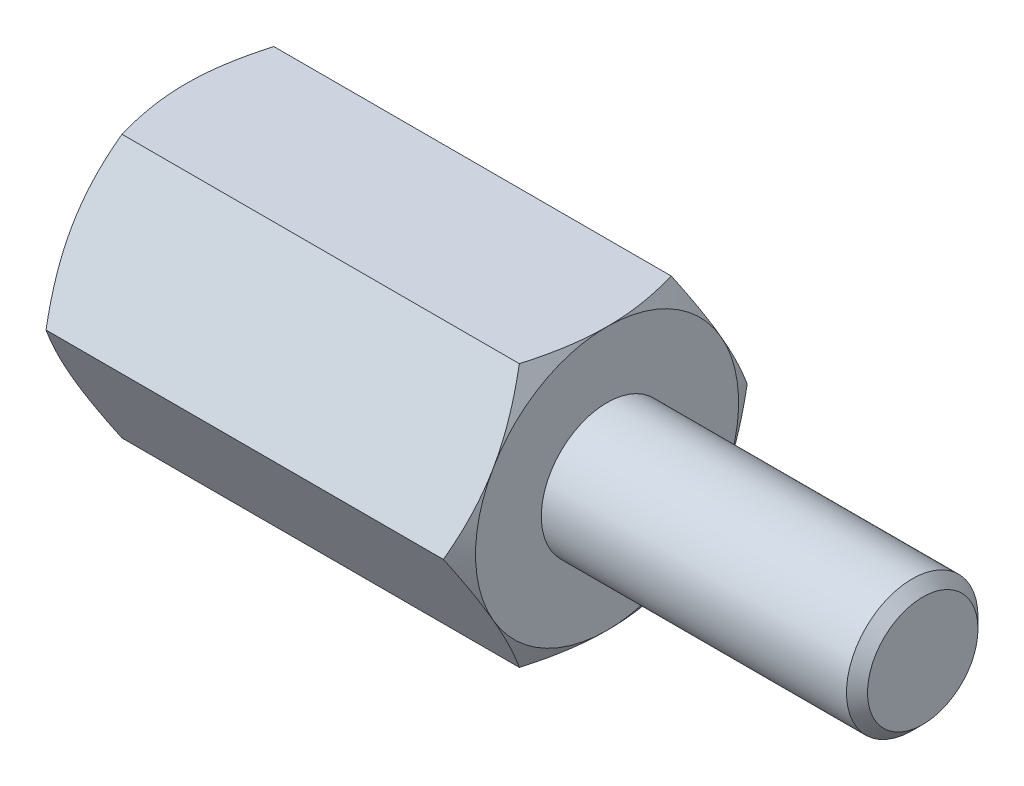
ISO-10303-21;
HEADER;
FILE_DESCRIPTION(('STEP AP214'),'2;1');
FILE_NAME('part.step','',(''),(''),'','','');
FILE_SCHEMA(('AUTOMOTIVE_DESIGN { 1 0 10303 214 1 1 1 1 }'));
ENDSEC;
DATA;
#1=APPLICATION_CONTEXT('core data for automotive mechanical design processes');
#2=APPLICATION_PROTOCOL_DEFINITION('international standard','automotive_design',2000,#1);
#3=PRODUCT_CONTEXT('',#1,'mechanical');
#4=PRODUCT('Part','Part','',(#3));
#5=PRODUCT_RELATED_PRODUCT_CATEGORY('part','',(#4));
#6=PRODUCT_DEFINITION_FORMATION('','',#4);
#7=PRODUCT_DEFINITION_CONTEXT('part definition',#1,'design');
#8=PRODUCT_DEFINITION('design','',#6,#7);
#9=PRODUCT_DEFINITION_SHAPE('','',#8);
#10=(LENGTH_UNIT() NAMED_UNIT(*) SI_UNIT(.MILLI.,.METRE.));
#11=(NAMED_UNIT(*) PLANE_ANGLE_UNIT() SI_UNIT($,.RADIAN.));
#12=(NAMED_UNIT(*) SI_UNIT($,.STERADIAN.) SOLID_ANGLE_UNIT());
#13=UNCERTAINTY_MEASURE_WITH_UNIT(LENGTH_MEASURE(1.E-05),#10,'distance_accuracy_value','');
#14=(GEOMETRIC_REPRESENTATION_CONTEXT(3) GLOBAL_UNCERTAINTY_ASSIGNED_CONTEXT((#13)) GLOBAL_UNIT_ASSIGNED_CONTEXT((#10,
#11,#12)) REPRESENTATION_CONTEXT('',''));
#15=CARTESIAN_POINT('',(0.,0.,0.));
#16=DIRECTION('',(0.,0.,1.));
#17=DIRECTION('',(1.,0.,0.));
#18=AXIS2_PLACEMENT_3D('',#15,#16,#17);
#19=CARTESIAN_POINT('',(4.,2.5,-1.44337567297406));
#20=DIRECTION('',(1.,0.,0.));
#21=DIRECTION('',(0.,0.,-1.));
#22=AXIS2_PLACEMENT_3D('',#19,#20,#21);
#23=PLANE('',#22);
#24=CARTESIAN_POINT('',(4.,0.,0.));
#25=DIRECTION('',(1.,0.,0.));
#26=DIRECTION('',(0.,0.,-1.));
#27=AXIS2_PLACEMENT_3D('',#24,#25,#26);
#28=CIRCLE('',#27,2.5);
#29=CARTESIAN_POINT('',(4.,-1.25,-2.1650635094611));
#30=VERTEX_POINT('',#29);
#31=CARTESIAN_POINT('',(4.,1.25,-2.1650635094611));
#32=VERTEX_POINT('',#31);
#33=EDGE_CURVE('E288',#30,#32,#28,.T.);
#34=ORIENTED_EDGE('',*,*,#33,.T.);
#35=CARTESIAN_POINT('',(4.,2.5,0.));
#36=VERTEX_POINT('',#35);
#37=EDGE_CURVE('E53',#32,#36,#28,.T.);
#38=ORIENTED_EDGE('',*,*,#37,.T.);
#39=CARTESIAN_POINT('',(4.,1.25,2.1650635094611));
#40=VERTEX_POINT('',#39);
#41=EDGE_CURVE('E296',#36,#40,#28,.T.);
#42=ORIENTED_EDGE('',*,*,#41,.T.);
#43=CARTESIAN_POINT('',(4.,-1.25,2.1650635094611));
#44=VERTEX_POINT('',#43);
#45=EDGE_CURVE('E301',#40,#44,#28,.T.);
#46=ORIENTED_EDGE('',*,*,#45,.T.);
#47=CARTESIAN_POINT('',(4.,0.,0.));
#48=DIRECTION('',(-1.,0.,0.));
#49=DIRECTION('',(0.,-1.,0.));
#50=AXIS2_PLACEMENT_3D('',#47,#48,#49);
#51=CIRCLE('',#50,2.5);
#52=CARTESIAN_POINT('',(4.,-2.5,0.));
#53=VERTEX_POINT('',#52);
#54=EDGE_CURVE('E193',#53,#44,#51,.T.);
#55=ORIENTED_EDGE('',*,*,#54,.F.);
#56=EDGE_CURVE('E61',#53,#30,#28,.T.);
#57=ORIENTED_EDGE('',*,*,#56,.T.);
#58=EDGE_LOOP('',(#34,#38,#42,#46,#55,#57));
#59=FACE_BOUND('',#58,.T.);
#60=CARTESIAN_POINT('',(4.,0.,0.));
#61=DIRECTION('',(1.,0.,0.));
#62=DIRECTION('',(0.,0.,-1.));
#63=AXIS2_PLACEMENT_3D('',#60,#61,#62);
#64=CIRCLE('',#63,1.25);
#65=CARTESIAN_POINT('',(4.,0.,-1.25));
#66=VERTEX_POINT('',#65);
#67=EDGE_CURVE('E421',#66,#66,#64,.T.);
#68=ORIENTED_EDGE('',*,*,#67,.F.);
#69=EDGE_LOOP('',(#68));
#70=FACE_BOUND('',#69,.T.);
#71=ADVANCED_FACE('F37',(#59,#70),#23,.T.);
#72=CARTESIAN_POINT('',(4.,0.,-2.88675134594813));
#73=DIRECTION('',(0.,-0.5,0.866025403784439));
#74=DIRECTION('',(0.,-0.866025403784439,-0.5));
#75=AXIS2_PLACEMENT_3D('',#72,#73,#74);
#76=PLANE('',#75);
#77=CARTESIAN_POINT('',(3.77664233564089,-0.000199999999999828,-2.88686681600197));
#78=CARTESIAN_POINT('',(3.81327837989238,0.109663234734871,-2.82343724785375));
#79=CARTESIAN_POINT('',(3.84659778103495,0.220474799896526,-2.75946016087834));
#80=CARTESIAN_POINT('',(3.90475771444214,0.444016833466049,-2.63039810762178));
#81=CARTESIAN_POINT('',(3.92957767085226,0.556751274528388,-2.5653108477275));
#82=CARTESIAN_POINT('',(3.96821434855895,0.780822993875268,-2.43594298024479));
#83=CARTESIAN_POINT('',(3.98228820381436,0.892125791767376,-2.37168227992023));
#84=CARTESIAN_POINT('',(3.99909084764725,1.11525522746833,-2.24285844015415));
#85=CARTESIAN_POINT('',(4.00183354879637,1.22708105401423,-2.17829576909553));
#86=CARTESIAN_POINT('',(3.99613423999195,1.43604197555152,-2.05765212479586));
#87=CARTESIAN_POINT('',(3.98909160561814,1.53320831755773,-2.0015531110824));
#88=CARTESIAN_POINT('',(3.96676858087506,1.726907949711,-1.88972057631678));
#89=CARTESIAN_POINT('',(3.95148056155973,1.82344056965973,-1.8339874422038));
#90=CARTESIAN_POINT('',(3.91326090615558,2.01753972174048,-1.7219242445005));
#91=CARTESIAN_POINT('',(3.89016722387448,2.11508168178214,-1.66560836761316));
#92=CARTESIAN_POINT('',(3.83775334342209,2.30871060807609,-1.55381665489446));
#93=CARTESIAN_POINT('',(3.80844546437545,2.40480005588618,-1.49833938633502));
#94=CARTESIAN_POINT('',(3.77664233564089,2.5002,-1.44326020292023));
#95=B_SPLINE_CURVE_WITH_KNOTS('',3,(#77,#78,#79,#80,#81,#82,#83,#84,#85,#86,#87,#88,#89,#90,#91,
#92,#93,#94),.UNSPECIFIED.,.F.,.F.,(4,2,2,2,2,2,2,2,4),(0.,0.396285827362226,0.79352433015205,
1.18093086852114,1.56786160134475,1.90479741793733,2.24204551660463,2.58677531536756,
2.93082800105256),.UNSPECIFIED.);
#96=CARTESIAN_POINT('',(3.7767090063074,0.,-2.88675134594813));
#97=VERTEX_POINT('',#96);
#98=EDGE_CURVE('E336',#97,#32,#95,.T.);
#99=ORIENTED_EDGE('',*,*,#98,.F.);
#100=DIRECTION('',(-1.,0.,0.));
#101=VECTOR('',#100,1.);
#102=CARTESIAN_POINT('',(4.,0.,-2.88675134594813));
#103=LINE('',#102,#101);
#104=CARTESIAN_POINT('',(-3.7767090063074,0.,-2.88675134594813));
#105=VERTEX_POINT('',#104);
#106=EDGE_CURVE('E264',#97,#105,#103,.T.);
#107=ORIENTED_EDGE('',*,*,#106,.T.);
#108=CARTESIAN_POINT('',(-3.77664233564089,2.5002,-1.44326020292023));
#109=CARTESIAN_POINT('',(-3.81327837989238,2.39033676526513,-1.50668977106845));
#110=CARTESIAN_POINT('',(-3.84659778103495,2.27952520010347,-1.57066685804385));
#111=CARTESIAN_POINT('',(-3.90475771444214,2.05598316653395,-1.69972891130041));
#112=CARTESIAN_POINT('',(-3.92957767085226,1.94324872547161,-1.7648161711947));
#113=CARTESIAN_POINT('',(-3.96821434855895,1.71917700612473,-1.8941840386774));
#114=CARTESIAN_POINT('',(-3.98228820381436,1.60787420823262,-1.95844473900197));
#115=CARTESIAN_POINT('',(-3.99909084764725,1.38474477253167,-2.08726857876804));
#116=CARTESIAN_POINT('',(-4.00183354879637,1.27291894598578,-2.15183124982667));
#117=CARTESIAN_POINT('',(-3.99613423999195,1.06395802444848,-2.27247489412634));
#118=CARTESIAN_POINT('',(-3.98909160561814,0.966791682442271,-2.32857390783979));
#119=CARTESIAN_POINT('',(-3.96676858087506,0.773092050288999,-2.44040644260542));
#120=CARTESIAN_POINT('',(-3.95148056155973,0.676559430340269,-2.49613957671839));
#121=CARTESIAN_POINT('',(-3.91326090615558,0.482460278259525,-2.60820277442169));
#122=CARTESIAN_POINT('',(-3.89016722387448,0.38491831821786,-2.66451865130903));
#123=CARTESIAN_POINT('',(-3.83775334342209,0.191289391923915,-2.77631036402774));
#124=CARTESIAN_POINT('',(-3.80844546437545,0.0951999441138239,-2.83178763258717));
#125=CARTESIAN_POINT('',(-3.77664233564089,-0.000200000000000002,-2.88686681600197));
#126=B_SPLINE_CURVE_WITH_KNOTS('',3,(#108,#109,#110,#111,#112,#113,#114,#115,#116,#117,#118,
#119,#120,#121,#122,#123,#124,#125),.UNSPECIFIED.,.F.,.F.,(4,2,2,2,2,2,2,2,4),(0.,
0.396285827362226,0.793524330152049,1.18093086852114,1.56786160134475,1.90479741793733,
2.24204551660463,2.58677531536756,2.93082800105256),.UNSPECIFIED.);
#127=CARTESIAN_POINT('',(-4.,1.25,-2.1650635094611));
#128=VERTEX_POINT('',#127);
#129=EDGE_CURVE('E370',#128,#105,#126,.T.);
#130=ORIENTED_EDGE('',*,*,#129,.F.);
#131=CARTESIAN_POINT('',(-3.7767090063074,2.5,-1.44337567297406));
#132=VERTEX_POINT('',#131);
#133=EDGE_CURVE('E371',#132,#128,#126,.T.);
#134=ORIENTED_EDGE('',*,*,#133,.F.);
#135=DIRECTION('',(-1.,0.,0.));
#136=VECTOR('',#135,1.);
#137=CARTESIAN_POINT('',(4.,2.5,-1.44337567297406));
#138=LINE('',#137,#136);
#139=CARTESIAN_POINT('',(3.77670900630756,2.5,-1.44337567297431));
#140=VERTEX_POINT('',#139);
#141=EDGE_CURVE('E279',#140,#132,#138,.T.);
#142=ORIENTED_EDGE('',*,*,#141,.F.);
#143=EDGE_CURVE('E229',#32,#140,#95,.T.);
#144=ORIENTED_EDGE('',*,*,#143,.F.);
#145=EDGE_LOOP('',(#99,#107,#130,#134,#142,#144));
#146=FACE_BOUND('',#145,.T.);
#147=ADVANCED_FACE('F148',(#146),#76,.F.);
#148=CARTESIAN_POINT('',(4.,2.5,-1.44337567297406));
#149=DIRECTION('',(0.,-1.,0.));
#150=DIRECTION('',(0.,0.,-1.));
#151=AXIS2_PLACEMENT_3D('',#148,#149,#150);
#152=PLANE('',#151);
#153=CARTESIAN_POINT('',(2.76803388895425,2.5,-3.90158441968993));
#154=CARTESIAN_POINT('',(2.82120772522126,2.5,-3.79217004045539));
#155=CARTESIAN_POINT('',(2.87387869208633,2.5,-3.68250707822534));
#156=CARTESIAN_POINT('',(2.97793249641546,2.5,-3.46255185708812));
#157=CARTESIAN_POINT('',(3.02931513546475,2.5,-3.35225950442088));
#158=CARTESIAN_POINT('',(3.13076309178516,2.5,-3.130356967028));
#159=CARTESIAN_POINT('',(3.18081992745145,2.5,-3.01874289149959));
#160=CARTESIAN_POINT('',(3.27891712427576,2.5,-2.79463535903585));
#161=CARTESIAN_POINT('',(3.32695757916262,2.5,-2.68214194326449));
#162=CARTESIAN_POINT('',(3.42201845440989,2.5,-2.45240385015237));
#163=CARTESIAN_POINT('',(3.46895431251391,2.5,-2.33512399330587));
#164=CARTESIAN_POINT('',(3.55933269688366,2.5,-2.09920133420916));
#165=CARTESIAN_POINT('',(3.60277483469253,2.5,-1.98055838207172));
#166=CARTESIAN_POINT('',(3.68504351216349,2.5,-1.74193489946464));
#167=CARTESIAN_POINT('',(3.72387917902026,2.5,-1.6219575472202));
#168=CARTESIAN_POINT('',(3.79570507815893,2.5,-1.38028205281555));
#169=CARTESIAN_POINT('',(3.82869712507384,2.5,-1.25858445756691));
#170=CARTESIAN_POINT('',(3.88709594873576,2.5,-1.01406369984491));
#171=CARTESIAN_POINT('',(3.91254379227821,2.5,-0.891250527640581));
#172=CARTESIAN_POINT('',(3.95442751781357,2.5,-0.64407172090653));
#173=CARTESIAN_POINT('',(3.97086432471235,2.5,-0.519706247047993));
#174=CARTESIAN_POINT('',(3.9932006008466,2.5,-0.271679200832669));
#175=CARTESIAN_POINT('',(3.99923751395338,2.5,-0.148030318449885));
#176=CARTESIAN_POINT('',(4.00062561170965,2.5,0.0993395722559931));
#177=CARTESIAN_POINT('',(3.99597656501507,2.5,0.223060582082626));
#178=CARTESIAN_POINT('',(3.97940443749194,2.5,0.432351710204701));
#179=CARTESIAN_POINT('',(3.97010665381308,2.5,0.518143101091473));
#180=CARTESIAN_POINT('',(3.94693847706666,2.5,0.689112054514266));
#181=CARTESIAN_POINT('',(3.93306748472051,2.5,0.774289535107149));
#182=CARTESIAN_POINT('',(3.88532020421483,2.5,1.02876599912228));
#183=CARTESIAN_POINT('',(3.84531764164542,2.5,1.19691958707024));
#184=CARTESIAN_POINT('',(3.75226567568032,2.5,1.53362893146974));
#185=CARTESIAN_POINT('',(3.69893620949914,2.5,1.70210423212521));
#186=CARTESIAN_POINT('',(3.61237169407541,2.5,1.95247339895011));
#187=CARTESIAN_POINT('',(3.58242477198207,2.5,2.03553184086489));
#188=CARTESIAN_POINT('',(3.52068409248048,2.5,2.20095860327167));
#189=CARTESIAN_POINT('',(3.48889037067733,2.5,2.2833269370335));
#190=CARTESIAN_POINT('',(3.40401426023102,2.5,2.49723312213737));
#191=CARTESIAN_POINT('',(3.34971733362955,2.5,2.6282879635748));
#192=CARTESIAN_POINT('',(3.23812739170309,2.5,2.88912034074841));
#193=CARTESIAN_POINT('',(3.1808341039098,2.5,3.01889775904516));
#194=CARTESIAN_POINT('',(3.06393487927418,2.5,3.27745045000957));
#195=CARTESIAN_POINT('',(3.00432825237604,2.5,3.40622540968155));
#196=CARTESIAN_POINT('',(2.8833234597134,2.5,3.66293235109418));
#197=CARTESIAN_POINT('',(2.82192524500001,2.5,3.79086430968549));
#198=CARTESIAN_POINT('',(2.6354580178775,2.5,4.17399495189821));
#199=CARTESIAN_POINT('',(2.50828249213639,2.5,4.42816724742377));
#200=CARTESIAN_POINT('',(2.25034557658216,2.5,4.93461464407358));
#201=CARTESIAN_POINT('',(2.11958483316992,2.5,5.18689007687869));
#202=CARTESIAN_POINT('',(1.86871001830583,2.5,5.66512451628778));
#203=CARTESIAN_POINT('',(1.74882986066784,2.5,5.89120644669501));
#204=CARTESIAN_POINT('',(1.50759021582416,2.5,6.34259369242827));
#205=CARTESIAN_POINT('',(1.38623065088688,2.5,6.56789896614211));
#206=CARTESIAN_POINT('',(1.14278038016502,2.5,7.01722044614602));
#207=CARTESIAN_POINT('',(1.02069305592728,2.5,7.24123848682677));
#208=CARTESIAN_POINT('',(0.775666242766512,2.5,7.68878772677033));
#209=CARTESIAN_POINT('',(0.652726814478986,2.5,7.9123189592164));
#210=CARTESIAN_POINT('',(0.529475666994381,2.5,8.13567697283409));
#211=B_SPLINE_CURVE_WITH_KNOTS('',3,(#153,#154,#155,#156,#157,#158,#159,#160,#161,#162,#163,
#164,#165,#166,#167,#168,#169,#170,#171,#172,#173,#174,#175,#176,#177,#178,#179,#180,#181,#182,
#183,#184,#185,#186,#187,#188,#189,#190,#191,#192,#193,#194,#195,#196,#197,#198,#199,#200,#201,
#202,#203,#204,#205,#206,#207,#208,#209,#210),.UNSPECIFIED.,.F.,.F.,(4,2,2,2,2,2,2,2,2,2,2,2,2,
2,2,2,2,2,2,2,2,2,2,2,2,2,2,2,4),(0.,0.364957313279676,0.729970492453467,1.09692930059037,
1.46387103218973,1.84279746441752,2.22176597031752,2.59997058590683,2.97805755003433,
3.35404692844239,3.72999770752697,4.10094071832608,4.47189175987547,4.73064905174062,
4.98944026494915,5.5072907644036,6.03710483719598,6.30196454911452,6.56681915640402,
6.99233818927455,7.41789598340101,7.84358170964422,8.26927907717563,9.12186602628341,
9.97430025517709,10.7419897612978,11.5097197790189,12.2750964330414,13.0404191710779),.UNSPECIFIED.);
#212=EDGE_CURVE('E227',#140,#36,#211,.T.);
#213=ORIENTED_EDGE('',*,*,#212,.F.);
#214=ORIENTED_EDGE('',*,*,#141,.T.);
#215=CARTESIAN_POINT('',(-2.76803388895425,2.5,-3.90158441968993));
#216=CARTESIAN_POINT('',(-2.82120772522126,2.5,-3.79217004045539));
#217=CARTESIAN_POINT('',(-2.87387869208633,2.5,-3.68250707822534));
#218=CARTESIAN_POINT('',(-2.97793249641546,2.5,-3.46255185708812));
#219=CARTESIAN_POINT('',(-3.02931513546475,2.5,-3.35225950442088));
#220=CARTESIAN_POINT('',(-3.13076309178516,2.5,-3.130356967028));
#221=CARTESIAN_POINT('',(-3.18081992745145,2.5,-3.01874289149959));
#222=CARTESIAN_POINT('',(-3.27891712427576,2.5,-2.79463535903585));
#223=CARTESIAN_POINT('',(-3.32695757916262,2.5,-2.68214194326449));
#224=CARTESIAN_POINT('',(-3.42201845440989,2.5,-2.45240385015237));
#225=CARTESIAN_POINT('',(-3.46895431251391,2.5,-2.33512399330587));
#226=CARTESIAN_POINT('',(-3.55933269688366,2.5,-2.09920133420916));
#227=CARTESIAN_POINT('',(-3.60277483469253,2.5,-1.98055838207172));
#228=CARTESIAN_POINT('',(-3.68504351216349,2.5,-1.74193489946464));
#229=CARTESIAN_POINT('',(-3.72387917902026,2.5,-1.6219575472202));
#230=CARTESIAN_POINT('',(-3.79570507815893,2.5,-1.38028205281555));
#231=CARTESIAN_POINT('',(-3.82869712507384,2.5,-1.25858445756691));
#232=CARTESIAN_POINT('',(-3.88709594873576,2.5,-1.01406369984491));
#233=CARTESIAN_POINT('',(-3.91254379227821,2.5,-0.89125052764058));
#234=CARTESIAN_POINT('',(-3.95442751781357,2.5,-0.64407172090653));
#235=CARTESIAN_POINT('',(-3.97086432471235,2.5,-0.519706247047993));
#236=CARTESIAN_POINT('',(-3.9932006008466,2.5,-0.271679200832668));
#237=CARTESIAN_POINT('',(-3.99923751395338,2.5,-0.148030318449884));
#238=CARTESIAN_POINT('',(-4.00062561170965,2.5,0.0993395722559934));
#239=CARTESIAN_POINT('',(-3.99597656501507,2.5,0.223060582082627));
#240=CARTESIAN_POINT('',(-3.97940443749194,2.5,0.432351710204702));
#241=CARTESIAN_POINT('',(-3.97010665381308,2.5,0.518143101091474));
#242=CARTESIAN_POINT('',(-3.94693847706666,2.5,0.689112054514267));
#243=CARTESIAN_POINT('',(-3.93306748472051,2.5,0.774289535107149));
#244=CARTESIAN_POINT('',(-3.88532020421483,2.5,1.02876599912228));
#245=CARTESIAN_POINT('',(-3.84531764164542,2.5,1.19691958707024));
#246=CARTESIAN_POINT('',(-3.75226567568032,2.5,1.53362893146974));
#247=CARTESIAN_POINT('',(-3.69893620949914,2.5,1.70210423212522));
#248=CARTESIAN_POINT('',(-3.61237169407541,2.5,1.95247339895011));
#249=CARTESIAN_POINT('',(-3.58242477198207,2.5,2.03553184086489));
#250=CARTESIAN_POINT('',(-3.52068409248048,2.5,2.20095860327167));
#251=CARTESIAN_POINT('',(-3.48889037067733,2.5,2.2833269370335));
#252=CARTESIAN_POINT('',(-3.40401426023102,2.5,2.49723312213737));
#253=CARTESIAN_POINT('',(-3.34971733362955,2.5,2.6282879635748));
#254=CARTESIAN_POINT('',(-3.23812739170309,2.5,2.88912034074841));
#255=CARTESIAN_POINT('',(-3.1808341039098,2.5,3.01889775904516));
#256=CARTESIAN_POINT('',(-3.06393487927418,2.5,3.27745045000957));
#257=CARTESIAN_POINT('',(-3.00432825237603,2.5,3.40622540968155));
#258=CARTESIAN_POINT('',(-2.8833234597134,2.5,3.66293235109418));
#259=CARTESIAN_POINT('',(-2.82192524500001,2.5,3.79086430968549));
#260=CARTESIAN_POINT('',(-2.6354580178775,2.5,4.17399495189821));
#261=CARTESIAN_POINT('',(-2.50828249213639,2.5,4.42816724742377));
#262=CARTESIAN_POINT('',(-2.25034557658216,2.5,4.93461464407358));
#263=CARTESIAN_POINT('',(-2.11958483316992,2.5,5.18689007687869));
#264=CARTESIAN_POINT('',(-1.86871001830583,2.5,5.66512451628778));
#265=CARTESIAN_POINT('',(-1.74882986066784,2.5,5.89120644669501));
#266=CARTESIAN_POINT('',(-1.50759021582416,2.5,6.34259369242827));
#267=CARTESIAN_POINT('',(-1.38623065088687,2.5,6.56789896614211));
#268=CARTESIAN_POINT('',(-1.14278038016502,2.5,7.01722044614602));
#269=CARTESIAN_POINT('',(-1.02069305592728,2.5,7.24123848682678));
#270=CARTESIAN_POINT('',(-0.775666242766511,2.5,7.68878772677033));
#271=CARTESIAN_POINT('',(-0.652726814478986,2.5,7.9123189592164));
#272=CARTESIAN_POINT('',(-0.529475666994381,2.5,8.13567697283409));
#273=B_SPLINE_CURVE_WITH_KNOTS('',3,(#215,#216,#217,#218,#219,#220,#221,#222,#223,#224,#225,
#226,#227,#228,#229,#230,#231,#232,#233,#234,#235,#236,#237,#238,#239,#240,#241,#242,#243,#244,
#245,#246,#247,#248,#249,#250,#251,#252,#253,#254,#255,#256,#257,#258,#259,#260,#261,#262,#263,
#264,#265,#266,#267,#268,#269,#270,#271,#272),.UNSPECIFIED.,.F.,.F.,(4,2,2,2,2,2,2,2,2,2,2,2,2,
2,2,2,2,2,2,2,2,2,2,2,2,2,2,2,4),(0.,0.364957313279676,0.729970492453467,1.09692930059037,
1.46387103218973,1.84279746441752,2.22176597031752,2.59997058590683,2.97805755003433,
3.35404692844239,3.72999770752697,4.10094071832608,4.47189175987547,4.73064905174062,
4.98944026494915,5.5072907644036,6.03710483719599,6.30196454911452,6.56681915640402,
6.99233818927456,7.41789598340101,7.84358170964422,8.26927907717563,9.12186602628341,
9.97430025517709,10.7419897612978,11.5097197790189,12.2750964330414,13.0404191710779),.UNSPECIFIED.);
#274=CARTESIAN_POINT('',(-4.,2.5,0.));
#275=VERTEX_POINT('',#274);
#276=EDGE_CURVE('E241',#275,#132,#273,.F.);
#277=ORIENTED_EDGE('',*,*,#276,.F.);
#278=CARTESIAN_POINT('',(-3.7767090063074,2.5,1.44337567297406));
#279=VERTEX_POINT('',#278);
#280=EDGE_CURVE('E249',#279,#275,#273,.F.);
#281=ORIENTED_EDGE('',*,*,#280,.F.);
#282=DIRECTION('',(-1.,0.,0.));
#283=VECTOR('',#282,1.);
#284=CARTESIAN_POINT('',(4.,2.5,1.44337567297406));
#285=LINE('',#284,#283);
#286=CARTESIAN_POINT('',(3.7767090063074,2.5,1.44337567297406));
#287=VERTEX_POINT('',#286);
#288=EDGE_CURVE('E276',#287,#279,#285,.T.);
#289=ORIENTED_EDGE('',*,*,#288,.F.);
#290=EDGE_CURVE('E221',#36,#287,#211,.T.);
#291=ORIENTED_EDGE('',*,*,#290,.F.);
#292=EDGE_LOOP('',(#213,#214,#277,#281,#289,#291));
#293=FACE_BOUND('',#292,.T.);
#294=ADVANCED_FACE('F153',(#293),#152,.F.);
#295=CARTESIAN_POINT('',(4.,2.5,1.44337567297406));
#296=DIRECTION('',(0.,-0.5,-0.866025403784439));
#297=DIRECTION('',(0.,0.866025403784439,-0.5));
#298=AXIS2_PLACEMENT_3D('',#295,#296,#297);
#299=PLANE('',#298);
#300=CARTESIAN_POINT('',(3.77664233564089,2.5002,1.44326020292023));
#301=CARTESIAN_POINT('',(3.81327837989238,2.39033676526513,1.50668977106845));
#302=CARTESIAN_POINT('',(3.84659778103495,2.27952520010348,1.57066685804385));
#303=CARTESIAN_POINT('',(3.90475771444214,2.05598316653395,1.69972891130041));
#304=CARTESIAN_POINT('',(3.92957767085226,1.94324872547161,1.7648161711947));
#305=CARTESIAN_POINT('',(3.96821434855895,1.71917700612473,1.8941840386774));
#306=CARTESIAN_POINT('',(3.98228820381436,1.60787420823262,1.95844473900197));
#307=CARTESIAN_POINT('',(3.99909084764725,1.38474477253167,2.08726857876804));
#308=CARTESIAN_POINT('',(4.00183354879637,1.27291894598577,2.15183124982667));
#309=CARTESIAN_POINT('',(3.99613423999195,1.06395802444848,2.27247489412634));
#310=CARTESIAN_POINT('',(3.98909160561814,0.96679168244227,2.32857390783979));
#311=CARTESIAN_POINT('',(3.96676858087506,0.773092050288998,2.44040644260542));
#312=CARTESIAN_POINT('',(3.95148056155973,0.676559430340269,2.49613957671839));
#313=CARTESIAN_POINT('',(3.91326090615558,0.482460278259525,2.60820277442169));
#314=CARTESIAN_POINT('',(3.89016722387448,0.384918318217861,2.66451865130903));
#315=CARTESIAN_POINT('',(3.83775334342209,0.191289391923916,2.77631036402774));
#316=CARTESIAN_POINT('',(3.80844546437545,0.0951999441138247,2.83178763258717));
#317=CARTESIAN_POINT('',(3.77664233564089,-0.000199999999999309,2.88686681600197));
#318=B_SPLINE_CURVE_WITH_KNOTS('',3,(#300,#301,#302,#303,#304,#305,#306,#307,#308,#309,#310,
#311,#312,#313,#314,#315,#316,#317),.UNSPECIFIED.,.F.,.F.,(4,2,2,2,2,2,2,2,4),(0.,
0.396285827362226,0.79352433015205,1.18093086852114,1.56786160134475,1.90479741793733,
2.24204551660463,2.58677531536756,2.93082800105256),.UNSPECIFIED.);
#319=EDGE_CURVE('E228',#287,#40,#318,.T.);
#320=ORIENTED_EDGE('',*,*,#319,.F.);
#321=ORIENTED_EDGE('',*,*,#288,.T.);
#322=CARTESIAN_POINT('',(-3.77664233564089,-0.00019999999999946,2.88686681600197));
#323=CARTESIAN_POINT('',(-3.81327837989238,0.109663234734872,2.82343724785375));
#324=CARTESIAN_POINT('',(-3.84659778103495,0.220474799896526,2.75946016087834));
#325=CARTESIAN_POINT('',(-3.90475771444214,0.44401683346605,2.63039810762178));
#326=CARTESIAN_POINT('',(-3.92957767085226,0.556751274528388,2.5653108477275));
#327=CARTESIAN_POINT('',(-3.96821434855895,0.780822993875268,2.43594298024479));
#328=CARTESIAN_POINT('',(-3.98228820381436,0.892125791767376,2.37168227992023));
#329=CARTESIAN_POINT('',(-3.99909084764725,1.11525522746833,2.24285844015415));
#330=CARTESIAN_POINT('',(-4.00183354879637,1.22708105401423,2.17829576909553));
#331=CARTESIAN_POINT('',(-3.99613423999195,1.43604197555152,2.05765212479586));
#332=CARTESIAN_POINT('',(-3.98909160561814,1.53320831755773,2.0015531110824));
#333=CARTESIAN_POINT('',(-3.96676858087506,1.726907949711,1.88972057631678));
#334=CARTESIAN_POINT('',(-3.95148056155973,1.82344056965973,1.8339874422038));
#335=CARTESIAN_POINT('',(-3.91326090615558,2.01753972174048,1.7219242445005));
#336=CARTESIAN_POINT('',(-3.89016722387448,2.11508168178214,1.66560836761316));
#337=CARTESIAN_POINT('',(-3.83775334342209,2.30871060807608,1.55381665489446));
#338=CARTESIAN_POINT('',(-3.80844546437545,2.40480005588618,1.49833938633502));
#339=CARTESIAN_POINT('',(-3.77664233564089,2.5002,1.44326020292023));
#340=B_SPLINE_CURVE_WITH_KNOTS('',3,(#322,#323,#324,#325,#326,#327,#328,#329,#330,#331,#332,
#333,#334,#335,#336,#337,#338,#339),.UNSPECIFIED.,.F.,.F.,(4,2,2,2,2,2,2,2,4),(0.,
0.396285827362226,0.793524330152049,1.18093086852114,1.56786160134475,1.90479741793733,
2.24204551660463,2.58677531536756,2.93082800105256),.UNSPECIFIED.);
#341=CARTESIAN_POINT('',(-4.,1.25,2.1650635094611));
#342=VERTEX_POINT('',#341);
#343=EDGE_CURVE('E255',#342,#279,#340,.T.);
#344=ORIENTED_EDGE('',*,*,#343,.F.);
#345=CARTESIAN_POINT('',(-3.7767090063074,0.,2.88675134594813));
#346=VERTEX_POINT('',#345);
#347=EDGE_CURVE('E262',#346,#342,#340,.T.);
#348=ORIENTED_EDGE('',*,*,#347,.F.);
#349=DIRECTION('',(-1.,0.,0.));
#350=VECTOR('',#349,1.);
#351=CARTESIAN_POINT('',(4.,0.,2.88675134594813));
#352=LINE('',#351,#350);
#353=CARTESIAN_POINT('',(3.7767090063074,0.,2.88675134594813));
#354=VERTEX_POINT('',#353);
#355=EDGE_CURVE('E273',#354,#346,#352,.T.);
#356=ORIENTED_EDGE('',*,*,#355,.F.);
#357=EDGE_CURVE('E215',#40,#354,#318,.T.);
#358=ORIENTED_EDGE('',*,*,#357,.F.);
#359=EDGE_LOOP('',(#320,#321,#344,#348,#356,#358));
#360=FACE_BOUND('',#359,.T.);
#361=ADVANCED_FACE('F235',(#360),#299,.F.);
#362=CARTESIAN_POINT('',(4.,0.,2.88675134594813));
#363=DIRECTION('',(0.,0.5,-0.866025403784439));
#364=DIRECTION('',(0.,0.866025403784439,0.5));
#365=AXIS2_PLACEMENT_3D('',#362,#363,#364);
#366=PLANE('',#365);
#367=CARTESIAN_POINT('',(3.77664233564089,0.000200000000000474,2.88686681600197));
#368=CARTESIAN_POINT('',(3.81327837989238,-0.109663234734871,2.82343724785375));
#369=CARTESIAN_POINT('',(3.84659778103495,-0.220474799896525,2.75946016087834));
#370=CARTESIAN_POINT('',(3.90475771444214,-0.444016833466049,2.63039810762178));
#371=CARTESIAN_POINT('',(3.92957767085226,-0.556751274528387,2.5653108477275));
#372=CARTESIAN_POINT('',(3.96821434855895,-0.780822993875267,2.43594298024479));
#373=CARTESIAN_POINT('',(3.98228820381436,-0.892125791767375,2.37168227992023));
#374=CARTESIAN_POINT('',(3.99909084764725,-1.11525522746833,2.24285844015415));
#375=CARTESIAN_POINT('',(4.00183354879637,-1.22708105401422,2.17829576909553));
#376=CARTESIAN_POINT('',(3.99613423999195,-1.43604197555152,2.05765212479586));
#377=CARTESIAN_POINT('',(3.98909160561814,-1.53320831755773,2.0015531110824));
#378=CARTESIAN_POINT('',(3.96676858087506,-1.726907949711,1.88972057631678));
#379=CARTESIAN_POINT('',(3.95148056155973,-1.82344056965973,1.8339874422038));
#380=CARTESIAN_POINT('',(3.91326090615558,-2.01753972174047,1.7219242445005));
#381=CARTESIAN_POINT('',(3.89016722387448,-2.11508168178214,1.66560836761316));
#382=CARTESIAN_POINT('',(3.83775334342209,-2.30871060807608,1.55381665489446));
#383=CARTESIAN_POINT('',(3.80844546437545,-2.40480005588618,1.49833938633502));
#384=CARTESIAN_POINT('',(3.77664233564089,-2.5002,1.44326020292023));
#385=B_SPLINE_CURVE_WITH_KNOTS('',3,(#367,#368,#369,#370,#371,#372,#373,#374,#375,#376,#377,
#378,#379,#380,#381,#382,#383,#384),.UNSPECIFIED.,.F.,.F.,(4,2,2,2,2,2,2,2,4),(0.,
0.396285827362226,0.793524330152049,1.18093086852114,1.56786160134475,1.90479741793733,
2.24204551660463,2.58677531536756,2.93082800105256),.UNSPECIFIED.);
#386=EDGE_CURVE('E312',#354,#44,#385,.T.);
#387=ORIENTED_EDGE('',*,*,#386,.F.);
#388=ORIENTED_EDGE('',*,*,#355,.T.);
#389=CARTESIAN_POINT('',(-3.77664233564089,-2.5002,1.44326020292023));
#390=CARTESIAN_POINT('',(-3.81327837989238,-2.39033676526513,1.50668977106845));
#391=CARTESIAN_POINT('',(-3.84659778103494,-2.27952520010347,1.57066685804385));
#392=CARTESIAN_POINT('',(-3.90475771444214,-2.05598316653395,1.69972891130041));
#393=CARTESIAN_POINT('',(-3.92957767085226,-1.94324872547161,1.7648161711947));
#394=CARTESIAN_POINT('',(-3.96821434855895,-1.71917700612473,1.8941840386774));
#395=CARTESIAN_POINT('',(-3.98228820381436,-1.60787420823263,1.95844473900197));
#396=CARTESIAN_POINT('',(-3.99909084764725,-1.38474477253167,2.08726857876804));
#397=CARTESIAN_POINT('',(-4.00183354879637,-1.27291894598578,2.15183124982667));
#398=CARTESIAN_POINT('',(-3.99613423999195,-1.06395802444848,2.27247489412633));
#399=CARTESIAN_POINT('',(-3.98909160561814,-0.966791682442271,2.32857390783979));
#400=CARTESIAN_POINT('',(-3.96676858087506,-0.773092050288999,2.44040644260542));
#401=CARTESIAN_POINT('',(-3.95148056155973,-0.676559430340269,2.49613957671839));
#402=CARTESIAN_POINT('',(-3.91326090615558,-0.482460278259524,2.60820277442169));
#403=CARTESIAN_POINT('',(-3.89016722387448,-0.38491831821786,2.66451865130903));
#404=CARTESIAN_POINT('',(-3.83775334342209,-0.191289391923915,2.77631036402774));
#405=CARTESIAN_POINT('',(-3.80844546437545,-0.0951999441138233,2.83178763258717));
#406=CARTESIAN_POINT('',(-3.77664233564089,0.000200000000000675,2.88686681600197));
#407=B_SPLINE_CURVE_WITH_KNOTS('',3,(#389,#390,#391,#392,#393,#394,#395,#396,#397,#398,#399,
#400,#401,#402,#403,#404,#405,#406),.UNSPECIFIED.,.F.,.F.,(4,2,2,2,2,2,2,2,4),(0.,
0.396285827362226,0.793524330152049,1.18093086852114,1.56786160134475,1.90479741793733,
2.24204551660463,2.58677531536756,2.93082800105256),.UNSPECIFIED.);
#408=CARTESIAN_POINT('',(-4.,-1.25,2.1650635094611));
#409=VERTEX_POINT('',#408);
#410=EDGE_CURVE('E263',#409,#346,#407,.T.);
#411=ORIENTED_EDGE('',*,*,#410,.F.);
#412=CARTESIAN_POINT('',(-3.7767090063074,-2.5,1.44337567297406));
#413=VERTEX_POINT('',#412);
#414=EDGE_CURVE('E250',#413,#409,#407,.T.);
#415=ORIENTED_EDGE('',*,*,#414,.F.);
#416=DIRECTION('',(-1.,0.,0.));
#417=VECTOR('',#416,1.);
#418=CARTESIAN_POINT('',(4.,-2.5,1.44337567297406));
#419=LINE('',#418,#417);
#420=CARTESIAN_POINT('',(3.7767090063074,-2.5,1.44337567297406));
#421=VERTEX_POINT('',#420);
#422=EDGE_CURVE('E270',#421,#413,#419,.T.);
#423=ORIENTED_EDGE('',*,*,#422,.F.);
#424=EDGE_CURVE('E210',#44,#421,#385,.T.);
#425=ORIENTED_EDGE('',*,*,#424,.F.);
#426=EDGE_LOOP('',(#387,#388,#411,#415,#423,#425));
#427=FACE_BOUND('',#426,.T.);
#428=ADVANCED_FACE('F360',(#427),#366,.F.);
#429=CARTESIAN_POINT('',(4.,-2.5,1.44337567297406));
#430=DIRECTION('',(0.,1.,0.));
#431=DIRECTION('',(0.,0.,1.));
#432=AXIS2_PLACEMENT_3D('',#429,#430,#431);
#433=PLANE('',#432);
#434=CARTESIAN_POINT('',(2.76803388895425,-2.5,-3.90158441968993));
#435=CARTESIAN_POINT('',(2.82120772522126,-2.5,-3.79217004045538));
#436=CARTESIAN_POINT('',(2.87387869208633,-2.5,-3.68250707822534));
#437=CARTESIAN_POINT('',(2.97793249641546,-2.5,-3.46255185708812));
#438=CARTESIAN_POINT('',(3.02931513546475,-2.5,-3.35225950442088));
#439=CARTESIAN_POINT('',(3.13076309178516,-2.5,-3.130356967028));
#440=CARTESIAN_POINT('',(3.18081992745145,-2.5,-3.01874289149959));
#441=CARTESIAN_POINT('',(3.27891712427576,-2.5,-2.79463535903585));
#442=CARTESIAN_POINT('',(3.32695757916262,-2.5,-2.68214194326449));
#443=CARTESIAN_POINT('',(3.42201845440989,-2.5,-2.45240385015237));
#444=CARTESIAN_POINT('',(3.46895431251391,-2.5,-2.33512399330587));
#445=CARTESIAN_POINT('',(3.55933269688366,-2.5,-2.09920133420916));
#446=CARTESIAN_POINT('',(3.60277483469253,-2.5,-1.98055838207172));
#447=CARTESIAN_POINT('',(3.68504351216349,-2.5,-1.74193489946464));
#448=CARTESIAN_POINT('',(3.72387917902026,-2.5,-1.6219575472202));
#449=CARTESIAN_POINT('',(3.79570507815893,-2.5,-1.38028205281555));
#450=CARTESIAN_POINT('',(3.82869712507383,-2.5,-1.25858445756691));
#451=CARTESIAN_POINT('',(3.88709594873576,-2.5,-1.01406369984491));
#452=CARTESIAN_POINT('',(3.91254379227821,-2.5,-0.891250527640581));
#453=CARTESIAN_POINT('',(3.95442751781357,-2.5,-0.644071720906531));
#454=CARTESIAN_POINT('',(3.97086432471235,-2.5,-0.519706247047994));
#455=CARTESIAN_POINT('',(3.9932006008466,-2.5,-0.27167920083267));
#456=CARTESIAN_POINT('',(3.99923751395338,-2.5,-0.148030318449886));
#457=CARTESIAN_POINT('',(4.00062561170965,-2.5,0.0993395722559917));
#458=CARTESIAN_POINT('',(3.99597656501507,-2.5,0.223060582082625));
#459=CARTESIAN_POINT('',(3.97940443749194,-2.5,0.432351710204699));
#460=CARTESIAN_POINT('',(3.97010665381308,-2.5,0.518143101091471));
#461=CARTESIAN_POINT('',(3.94693847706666,-2.5,0.689112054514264));
#462=CARTESIAN_POINT('',(3.93306748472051,-2.5,0.774289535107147));
#463=CARTESIAN_POINT('',(3.88532020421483,-2.5,1.02876599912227));
#464=CARTESIAN_POINT('',(3.84531764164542,-2.5,1.19691958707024));
#465=CARTESIAN_POINT('',(3.75226567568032,-2.5,1.53362893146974));
#466=CARTESIAN_POINT('',(3.69893620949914,-2.5,1.70210423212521));
#467=CARTESIAN_POINT('',(3.61237169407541,-2.5,1.95247339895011));
#468=CARTESIAN_POINT('',(3.58242477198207,-2.5,2.03553184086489));
#469=CARTESIAN_POINT('',(3.52068409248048,-2.5,2.20095860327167));
#470=CARTESIAN_POINT('',(3.48889037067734,-2.5,2.2833269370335));
#471=CARTESIAN_POINT('',(3.40401426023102,-2.5,2.49723312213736));
#472=CARTESIAN_POINT('',(3.34971733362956,-2.5,2.6282879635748));
#473=CARTESIAN_POINT('',(3.2381273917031,-2.5,2.8891203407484));
#474=CARTESIAN_POINT('',(3.1808341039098,-2.5,3.01889775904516));
#475=CARTESIAN_POINT('',(3.06393487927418,-2.5,3.27745045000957));
#476=CARTESIAN_POINT('',(3.00432825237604,-2.5,3.40622540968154));
#477=CARTESIAN_POINT('',(2.8833234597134,-2.5,3.66293235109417));
#478=CARTESIAN_POINT('',(2.82192524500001,-2.5,3.79086430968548));
#479=CARTESIAN_POINT('',(2.6354580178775,-2.5,4.1739949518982));
#480=CARTESIAN_POINT('',(2.50828249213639,-2.5,4.42816724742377));
#481=CARTESIAN_POINT('',(2.25034557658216,-2.5,4.93461464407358));
#482=CARTESIAN_POINT('',(2.11958483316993,-2.5,5.18689007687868));
#483=CARTESIAN_POINT('',(1.86871001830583,-2.5,5.66512451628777));
#484=CARTESIAN_POINT('',(1.74882986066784,-2.5,5.891206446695));
#485=CARTESIAN_POINT('',(1.50759021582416,-2.5,6.34259369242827));
#486=CARTESIAN_POINT('',(1.38623065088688,-2.5,6.5678989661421));
#487=CARTESIAN_POINT('',(1.14278038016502,-2.5,7.01722044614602));
#488=CARTESIAN_POINT('',(1.02069305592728,-2.5,7.24123848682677));
#489=CARTESIAN_POINT('',(0.775666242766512,-2.5,7.68878772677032));
#490=CARTESIAN_POINT('',(0.652726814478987,-2.5,7.9123189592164));
#491=CARTESIAN_POINT('',(0.529475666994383,-2.5,8.13567697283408));
#492=B_SPLINE_CURVE_WITH_KNOTS('',3,(#434,#435,#436,#437,#438,#439,#440,#441,#442,#443,#444,
#445,#446,#447,#448,#449,#450,#451,#452,#453,#454,#455,#456,#457,#458,#459,#460,#461,#462,#463,
#464,#465,#466,#467,#468,#469,#470,#471,#472,#473,#474,#475,#476,#477,#478,#479,#480,#481,#482,
#483,#484,#485,#486,#487,#488,#489,#490,#491),.UNSPECIFIED.,.F.,.F.,(4,2,2,2,2,2,2,2,2,2,2,2,2,
2,2,2,2,2,2,2,2,2,2,2,2,2,2,2,4),(0.,0.364957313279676,0.729970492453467,1.09692930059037,
1.46387103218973,1.84279746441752,2.22176597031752,2.59997058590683,2.97805755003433,
3.35404692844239,3.72999770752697,4.10094071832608,4.47189175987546,4.73064905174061,
4.98944026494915,5.50729076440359,6.03710483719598,6.30196454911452,6.56681915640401,
6.99233818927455,7.417895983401,7.84358170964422,8.26927907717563,9.1218660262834,
9.97430025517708,10.7419897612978,11.5097197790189,12.2750964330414,13.0404191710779),.UNSPECIFIED.);
#493=EDGE_CURVE('E318',#421,#53,#492,.F.);
#494=ORIENTED_EDGE('',*,*,#493,.F.);
#495=ORIENTED_EDGE('',*,*,#422,.T.);
#496=CARTESIAN_POINT('',(-2.76803388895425,-2.5,-3.90158441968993));
#497=CARTESIAN_POINT('',(-2.82120772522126,-2.5,-3.79217004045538));
#498=CARTESIAN_POINT('',(-2.87387869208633,-2.5,-3.68250707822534));
#499=CARTESIAN_POINT('',(-2.97793249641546,-2.5,-3.46255185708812));
#500=CARTESIAN_POINT('',(-3.02931513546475,-2.5,-3.35225950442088));
#501=CARTESIAN_POINT('',(-3.13076309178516,-2.5,-3.130356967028));
#502=CARTESIAN_POINT('',(-3.18081992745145,-2.5,-3.01874289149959));
#503=CARTESIAN_POINT('',(-3.27891712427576,-2.5,-2.79463535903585));
#504=CARTESIAN_POINT('',(-3.32695757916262,-2.5,-2.68214194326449));
#505=CARTESIAN_POINT('',(-3.42201845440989,-2.5,-2.45240385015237));
#506=CARTESIAN_POINT('',(-3.46895431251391,-2.5,-2.33512399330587));
#507=CARTESIAN_POINT('',(-3.55933269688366,-2.5,-2.09920133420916));
#508=CARTESIAN_POINT('',(-3.60277483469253,-2.5,-1.98055838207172));
#509=CARTESIAN_POINT('',(-3.68504351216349,-2.5,-1.74193489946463));
#510=CARTESIAN_POINT('',(-3.72387917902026,-2.5,-1.6219575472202));
#511=CARTESIAN_POINT('',(-3.79570507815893,-2.5,-1.38028205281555));
#512=CARTESIAN_POINT('',(-3.82869712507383,-2.5,-1.25858445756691));
#513=CARTESIAN_POINT('',(-3.88709594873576,-2.5,-1.01406369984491));
#514=CARTESIAN_POINT('',(-3.91254379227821,-2.5,-0.891250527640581));
#515=CARTESIAN_POINT('',(-3.95442751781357,-2.5,-0.64407172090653));
#516=CARTESIAN_POINT('',(-3.97086432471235,-2.5,-0.519706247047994));
#517=CARTESIAN_POINT('',(-3.9932006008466,-2.5,-0.271679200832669));
#518=CARTESIAN_POINT('',(-3.99923751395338,-2.5,-0.148030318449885));
#519=CARTESIAN_POINT('',(-4.00062561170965,-2.5,0.0993395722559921));
#520=CARTESIAN_POINT('',(-3.99597656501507,-2.5,0.223060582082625));
#521=CARTESIAN_POINT('',(-3.97940443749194,-2.5,0.4323517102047));
#522=CARTESIAN_POINT('',(-3.97010665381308,-2.5,0.518143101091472));
#523=CARTESIAN_POINT('',(-3.94693847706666,-2.5,0.689112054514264));
#524=CARTESIAN_POINT('',(-3.93306748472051,-2.5,0.774289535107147));
#525=CARTESIAN_POINT('',(-3.88532020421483,-2.5,1.02876599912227));
#526=CARTESIAN_POINT('',(-3.84531764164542,-2.5,1.19691958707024));
#527=CARTESIAN_POINT('',(-3.75226567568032,-2.5,1.53362893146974));
#528=CARTESIAN_POINT('',(-3.69893620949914,-2.5,1.70210423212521));
#529=CARTESIAN_POINT('',(-3.61237169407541,-2.5,1.95247339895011));
#530=CARTESIAN_POINT('',(-3.58242477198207,-2.5,2.03553184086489));
#531=CARTESIAN_POINT('',(-3.52068409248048,-2.5,2.20095860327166));
#532=CARTESIAN_POINT('',(-3.48889037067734,-2.5,2.28332693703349));
#533=CARTESIAN_POINT('',(-3.40401426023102,-2.5,2.49723312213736));
#534=CARTESIAN_POINT('',(-3.34971733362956,-2.5,2.6282879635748));
#535=CARTESIAN_POINT('',(-3.2381273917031,-2.5,2.8891203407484));
#536=CARTESIAN_POINT('',(-3.1808341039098,-2.5,3.01889775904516));
#537=CARTESIAN_POINT('',(-3.06393487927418,-2.5,3.27745045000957));
#538=CARTESIAN_POINT('',(-3.00432825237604,-2.5,3.40622540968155));
#539=CARTESIAN_POINT('',(-2.8833234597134,-2.5,3.66293235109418));
#540=CARTESIAN_POINT('',(-2.82192524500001,-2.5,3.79086430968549));
#541=CARTESIAN_POINT('',(-2.6354580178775,-2.5,4.17399495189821));
#542=CARTESIAN_POINT('',(-2.50828249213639,-2.5,4.42816724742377));
#543=CARTESIAN_POINT('',(-2.25034557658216,-2.5,4.93461464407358));
#544=CARTESIAN_POINT('',(-2.11958483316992,-2.5,5.18689007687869));
#545=CARTESIAN_POINT('',(-1.86871001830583,-2.5,5.66512451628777));
#546=CARTESIAN_POINT('',(-1.74882986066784,-2.5,5.89120644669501));
#547=CARTESIAN_POINT('',(-1.50759021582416,-2.5,6.34259369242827));
#548=CARTESIAN_POINT('',(-1.38623065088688,-2.5,6.5678989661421));
#549=CARTESIAN_POINT('',(-1.14278038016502,-2.5,7.01722044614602));
#550=CARTESIAN_POINT('',(-1.02069305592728,-2.5,7.24123848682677));
#551=CARTESIAN_POINT('',(-0.775666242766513,-2.5,7.68878772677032));
#552=CARTESIAN_POINT('',(-0.652726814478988,-2.5,7.9123189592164));
#553=CARTESIAN_POINT('',(-0.529475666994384,-2.5,8.13567697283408));
#554=B_SPLINE_CURVE_WITH_KNOTS('',3,(#496,#497,#498,#499,#500,#501,#502,#503,#504,#505,#506,
#507,#508,#509,#510,#511,#512,#513,#514,#515,#516,#517,#518,#519,#520,#521,#522,#523,#524,#525,
#526,#527,#528,#529,#530,#531,#532,#533,#534,#535,#536,#537,#538,#539,#540,#541,#542,#543,#544,
#545,#546,#547,#548,#549,#550,#551,#552,#553),.UNSPECIFIED.,.F.,.F.,(4,2,2,2,2,2,2,2,2,2,2,2,2,
2,2,2,2,2,2,2,2,2,2,2,2,2,2,2,4),(0.,0.364957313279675,0.729970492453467,1.09692930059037,
1.46387103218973,1.84279746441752,2.22176597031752,2.59997058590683,2.97805755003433,
3.35404692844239,3.72999770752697,4.10094071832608,4.47189175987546,4.73064905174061,
4.98944026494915,5.50729076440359,6.03710483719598,6.30196454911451,6.56681915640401,
6.99233818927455,7.417895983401,7.84358170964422,8.26927907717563,9.12186602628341,
9.97430025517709,10.7419897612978,11.5097197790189,12.2750964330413,13.0404191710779),.UNSPECIFIED.);
#555=CARTESIAN_POINT('',(-4.,-2.5,0.));
#556=VERTEX_POINT('',#555);
#557=EDGE_CURVE('E375',#556,#413,#554,.T.);
#558=ORIENTED_EDGE('',*,*,#557,.F.);
#559=CARTESIAN_POINT('',(-3.7767090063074,-2.5,-1.44337567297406));
#560=VERTEX_POINT('',#559);
#561=EDGE_CURVE('E372',#560,#556,#554,.T.);
#562=ORIENTED_EDGE('',*,*,#561,.F.);
#563=DIRECTION('',(-1.,0.,0.));
#564=VECTOR('',#563,1.);
#565=CARTESIAN_POINT('',(4.,-2.5,-1.44337567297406));
#566=LINE('',#565,#564);
#567=CARTESIAN_POINT('',(3.7767090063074,-2.5,-1.44337567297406));
#568=VERTEX_POINT('',#567);
#569=EDGE_CURVE('E267',#568,#560,#566,.T.);
#570=ORIENTED_EDGE('',*,*,#569,.F.);
#571=EDGE_CURVE('E195',#53,#568,#492,.F.);
#572=ORIENTED_EDGE('',*,*,#571,.F.);
#573=EDGE_LOOP('',(#494,#495,#558,#562,#570,#572));
#574=FACE_BOUND('',#573,.T.);
#575=ADVANCED_FACE('F172',(#574),#433,.F.);
#576=CARTESIAN_POINT('',(4.,-2.5,-1.44337567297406));
#577=DIRECTION('',(0.,0.5,0.866025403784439));
#578=DIRECTION('',(0.,-0.866025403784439,0.5));
#579=AXIS2_PLACEMENT_3D('',#576,#577,#578);
#580=PLANE('',#579);
#581=CARTESIAN_POINT('',(3.77664233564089,-2.5002,-1.44326020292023));
#582=CARTESIAN_POINT('',(3.81327837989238,-2.39033676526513,-1.50668977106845));
#583=CARTESIAN_POINT('',(3.84659778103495,-2.27952520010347,-1.57066685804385));
#584=CARTESIAN_POINT('',(3.90475771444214,-2.05598316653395,-1.69972891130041));
#585=CARTESIAN_POINT('',(3.92957767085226,-1.94324872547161,-1.7648161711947));
#586=CARTESIAN_POINT('',(3.96821434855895,-1.71917700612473,-1.8941840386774));
#587=CARTESIAN_POINT('',(3.98228820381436,-1.60787420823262,-1.95844473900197));
#588=CARTESIAN_POINT('',(3.99909084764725,-1.38474477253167,-2.08726857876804));
#589=CARTESIAN_POINT('',(4.00183354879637,-1.27291894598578,-2.15183124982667));
#590=CARTESIAN_POINT('',(3.99613423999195,-1.06395802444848,-2.27247489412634));
#591=CARTESIAN_POINT('',(3.98909160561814,-0.966791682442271,-2.32857390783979));
#592=CARTESIAN_POINT('',(3.96676858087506,-0.773092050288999,-2.44040644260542));
#593=CARTESIAN_POINT('',(3.95148056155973,-0.676559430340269,-2.49613957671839));
#594=CARTESIAN_POINT('',(3.91326090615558,-0.482460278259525,-2.60820277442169));
#595=CARTESIAN_POINT('',(3.89016722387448,-0.38491831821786,-2.66451865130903));
#596=CARTESIAN_POINT('',(3.83775334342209,-0.191289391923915,-2.77631036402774));
#597=CARTESIAN_POINT('',(3.80844546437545,-0.0951999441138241,-2.83178763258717));
#598=CARTESIAN_POINT('',(3.77664233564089,0.00019999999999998,-2.88686681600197));
#599=B_SPLINE_CURVE_WITH_KNOTS('',3,(#581,#582,#583,#584,#585,#586,#587,#588,#589,#590,#591,
#592,#593,#594,#595,#596,#597,#598),.UNSPECIFIED.,.F.,.F.,(4,2,2,2,2,2,2,2,4),(0.,
0.396285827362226,0.793524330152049,1.18093086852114,1.56786160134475,1.90479741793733,
2.24204551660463,2.58677531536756,2.93082800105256),.UNSPECIFIED.);
#600=EDGE_CURVE('E192',#568,#30,#599,.T.);
#601=ORIENTED_EDGE('',*,*,#600,.F.);
#602=ORIENTED_EDGE('',*,*,#569,.T.);
#603=CARTESIAN_POINT('',(-3.77664233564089,0.000200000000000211,-2.88686681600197));
#604=CARTESIAN_POINT('',(-3.81327837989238,-0.109663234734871,-2.82343724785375));
#605=CARTESIAN_POINT('',(-3.84659778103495,-0.220474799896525,-2.75946016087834));
#606=CARTESIAN_POINT('',(-3.90475771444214,-0.444016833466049,-2.63039810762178));
#607=CARTESIAN_POINT('',(-3.92957767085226,-0.556751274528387,-2.5653108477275));
#608=CARTESIAN_POINT('',(-3.96821434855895,-0.780822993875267,-2.43594298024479));
#609=CARTESIAN_POINT('',(-3.98228820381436,-0.892125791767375,-2.37168227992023));
#610=CARTESIAN_POINT('',(-3.99909084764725,-1.11525522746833,-2.24285844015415));
#611=CARTESIAN_POINT('',(-4.00183354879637,-1.22708105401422,-2.17829576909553));
#612=CARTESIAN_POINT('',(-3.99613423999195,-1.43604197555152,-2.05765212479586));
#613=CARTESIAN_POINT('',(-3.98909160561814,-1.53320831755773,-2.0015531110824));
#614=CARTESIAN_POINT('',(-3.96676858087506,-1.726907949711,-1.88972057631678));
#615=CARTESIAN_POINT('',(-3.95148056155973,-1.82344056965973,-1.8339874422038));
#616=CARTESIAN_POINT('',(-3.91326090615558,-2.01753972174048,-1.7219242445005));
#617=CARTESIAN_POINT('',(-3.89016722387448,-2.11508168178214,-1.66560836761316));
#618=CARTESIAN_POINT('',(-3.83775334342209,-2.30871060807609,-1.55381665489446));
#619=CARTESIAN_POINT('',(-3.80844546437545,-2.40480005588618,-1.49833938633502));
#620=CARTESIAN_POINT('',(-3.77664233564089,-2.5002,-1.44326020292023));
#621=B_SPLINE_CURVE_WITH_KNOTS('',3,(#603,#604,#605,#606,#607,#608,#609,#610,#611,#612,#613,
#614,#615,#616,#617,#618,#619,#620),.UNSPECIFIED.,.F.,.F.,(4,2,2,2,2,2,2,2,4),(0.,
0.396285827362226,0.793524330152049,1.18093086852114,1.56786160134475,1.90479741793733,
2.24204551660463,2.58677531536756,2.93082800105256),.UNSPECIFIED.);
#622=CARTESIAN_POINT('',(-4.,-1.25,-2.1650635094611));
#623=VERTEX_POINT('',#622);
#624=EDGE_CURVE('E178',#623,#560,#621,.T.);
#625=ORIENTED_EDGE('',*,*,#624,.F.);
#626=EDGE_CURVE('E376',#105,#623,#621,.T.);
#627=ORIENTED_EDGE('',*,*,#626,.F.);
#628=ORIENTED_EDGE('',*,*,#106,.F.);
#629=EDGE_CURVE('E185',#30,#97,#599,.T.);
#630=ORIENTED_EDGE('',*,*,#629,.F.);
#631=EDGE_LOOP('',(#601,#602,#625,#627,#628,#630));
#632=FACE_BOUND('',#631,.T.);
#633=ADVANCED_FACE('F167',(#632),#580,.F.);
#634=CARTESIAN_POINT('',(-4.,0.,0.));
#635=DIRECTION('',(1.,0.,0.));
#636=DIRECTION('',(0.,1.,0.));
#637=AXIS2_PLACEMENT_3D('',#634,#635,#636);
#638=CONICAL_SURFACE('',#637,2.5,1.0471975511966);
#639=ORIENTED_EDGE('',*,*,#129,.T.);
#640=ORIENTED_EDGE('',*,*,#626,.T.);
#641=CARTESIAN_POINT('',(-4.,0.,0.));
#642=DIRECTION('',(1.,0.,0.));
#643=DIRECTION('',(0.,0.,-1.));
#644=AXIS2_PLACEMENT_3D('',#641,#642,#643);
#645=CIRCLE('',#644,2.5);
#646=EDGE_CURVE('E282',#623,#128,#645,.T.);
#647=ORIENTED_EDGE('',*,*,#646,.T.);
#648=EDGE_LOOP('',(#639,#640,#647));
#649=FACE_BOUND('',#648,.T.);
#650=ADVANCED_FACE('F171',(#649),#638,.T.);
#651=ORIENTED_EDGE('',*,*,#561,.T.);
#652=EDGE_CURVE('E286',#556,#623,#645,.T.);
#653=ORIENTED_EDGE('',*,*,#652,.T.);
#654=ORIENTED_EDGE('',*,*,#624,.T.);
#655=EDGE_LOOP('',(#651,#653,#654));
#656=FACE_BOUND('',#655,.T.);
#657=ADVANCED_FACE('F414',(#656),#638,.T.);
#658=ORIENTED_EDGE('',*,*,#414,.T.);
#659=CARTESIAN_POINT('',(-4.,0.,0.));
#660=DIRECTION('',(-1.,0.,0.));
#661=DIRECTION('',(0.,-1.,0.));
#662=AXIS2_PLACEMENT_3D('',#659,#660,#661);
#663=CIRCLE('',#662,2.5);
#664=EDGE_CURVE('E342',#556,#409,#663,.T.);
#665=ORIENTED_EDGE('',*,*,#664,.F.);
#666=ORIENTED_EDGE('',*,*,#557,.T.);
#667=EDGE_LOOP('',(#658,#665,#666));
#668=FACE_BOUND('',#667,.T.);
#669=ADVANCED_FACE('F534',(#668),#638,.T.);
#670=ORIENTED_EDGE('',*,*,#347,.T.);
#671=EDGE_CURVE('E411',#342,#409,#645,.T.);
#672=ORIENTED_EDGE('',*,*,#671,.T.);
#673=ORIENTED_EDGE('',*,*,#410,.T.);
#674=EDGE_LOOP('',(#670,#672,#673));
#675=FACE_BOUND('',#674,.T.);
#676=ADVANCED_FACE('F158',(#675),#638,.T.);
#677=ORIENTED_EDGE('',*,*,#343,.T.);
#678=ORIENTED_EDGE('',*,*,#280,.T.);
#679=EDGE_CURVE('E404',#275,#342,#645,.T.);
#680=ORIENTED_EDGE('',*,*,#679,.T.);
#681=EDGE_LOOP('',(#677,#678,#680));
#682=FACE_BOUND('',#681,.T.);
#683=ADVANCED_FACE('F402',(#682),#638,.T.);
#684=ORIENTED_EDGE('',*,*,#276,.T.);
#685=ORIENTED_EDGE('',*,*,#133,.T.);
#686=EDGE_CURVE('E287',#128,#275,#645,.T.);
#687=ORIENTED_EDGE('',*,*,#686,.T.);
#688=EDGE_LOOP('',(#684,#685,#687));
#689=FACE_BOUND('',#688,.T.);
#690=ADVANCED_FACE('F165',(#689),#638,.T.);
#691=CARTESIAN_POINT('',(-4.,2.5,-1.44337567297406));
#692=DIRECTION('',(1.,0.,0.));
#693=DIRECTION('',(0.,0.,-1.));
#694=AXIS2_PLACEMENT_3D('',#691,#692,#693);
#695=PLANE('',#694);
#696=CARTESIAN_POINT('',(-4.,0.,0.));
#697=DIRECTION('',(-1.,0.,0.));
#698=DIRECTION('',(0.,0.,1.));
#699=AXIS2_PLACEMENT_3D('',#696,#697,#698);
#700=CIRCLE('',#699,1.05);
#701=CARTESIAN_POINT('',(-4.,0.,1.05));
#702=VERTEX_POINT('',#701);
#703=EDGE_CURVE('E415',#702,#702,#700,.T.);
#704=ORIENTED_EDGE('',*,*,#703,.F.);
#705=EDGE_LOOP('',(#704));
#706=FACE_BOUND('',#705,.T.);
#707=ORIENTED_EDGE('',*,*,#686,.F.);
#708=ORIENTED_EDGE('',*,*,#646,.F.);
#709=ORIENTED_EDGE('',*,*,#652,.F.);
#710=ORIENTED_EDGE('',*,*,#664,.T.);
#711=ORIENTED_EDGE('',*,*,#671,.F.);
#712=ORIENTED_EDGE('',*,*,#679,.F.);
#713=EDGE_LOOP('',(#707,#708,#709,#710,#711,#712));
#714=FACE_BOUND('',#713,.T.);
#715=ADVANCED_FACE('F161',(#706,#714),#695,.F.);
#716=CARTESIAN_POINT('',(4.,0.,0.));
#717=DIRECTION('',(-1.,0.,0.));
#718=DIRECTION('',(0.,1.,0.));
#719=AXIS2_PLACEMENT_3D('',#716,#717,#718);
#720=CONICAL_SURFACE('',#719,2.5,1.0471975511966);
#721=ORIENTED_EDGE('',*,*,#98,.T.);
#722=ORIENTED_EDGE('',*,*,#33,.F.);
#723=ORIENTED_EDGE('',*,*,#629,.T.);
#724=EDGE_LOOP('',(#721,#722,#723));
#725=FACE_BOUND('',#724,.T.);
#726=ADVANCED_FACE('F164',(#725),#720,.T.);
#727=ORIENTED_EDGE('',*,*,#571,.T.);
#728=ORIENTED_EDGE('',*,*,#600,.T.);
#729=ORIENTED_EDGE('',*,*,#56,.F.);
#730=EDGE_LOOP('',(#727,#728,#729));
#731=FACE_BOUND('',#730,.T.);
#732=ADVANCED_FACE('F202',(#731),#720,.T.);
#733=ORIENTED_EDGE('',*,*,#424,.T.);
#734=ORIENTED_EDGE('',*,*,#493,.T.);
#735=ORIENTED_EDGE('',*,*,#54,.T.);
#736=EDGE_LOOP('',(#733,#734,#735));
#737=FACE_BOUND('',#736,.T.);
#738=ADVANCED_FACE('F427',(#737),#720,.T.);
#739=ORIENTED_EDGE('',*,*,#357,.T.);
#740=ORIENTED_EDGE('',*,*,#386,.T.);
#741=ORIENTED_EDGE('',*,*,#45,.F.);
#742=EDGE_LOOP('',(#739,#740,#741));
#743=FACE_BOUND('',#742,.T.);
#744=ADVANCED_FACE('F357',(#743),#720,.T.);
#745=ORIENTED_EDGE('',*,*,#290,.T.);
#746=ORIENTED_EDGE('',*,*,#319,.T.);
#747=ORIENTED_EDGE('',*,*,#41,.F.);
#748=EDGE_LOOP('',(#745,#746,#747));
#749=FACE_BOUND('',#748,.T.);
#750=ADVANCED_FACE('F352',(#749),#720,.T.);
#751=ORIENTED_EDGE('',*,*,#143,.T.);
#752=ORIENTED_EDGE('',*,*,#212,.T.);
#753=ORIENTED_EDGE('',*,*,#37,.F.);
#754=EDGE_LOOP('',(#751,#752,#753));
#755=FACE_BOUND('',#754,.T.);
#756=ADVANCED_FACE('F143',(#755),#720,.T.);
#757=CARTESIAN_POINT('',(1.,0.,0.));
#758=DIRECTION('',(-1.,0.,0.));
#759=DIRECTION('',(0.,0.,1.));
#760=AXIS2_PLACEMENT_3D('',#757,#758,#759);
#761=CYLINDRICAL_SURFACE('',#760,1.05);
#762=CARTESIAN_POINT('',(1.,0.,0.));
#763=DIRECTION('',(1.,0.,0.));
#764=DIRECTION('',(0.,0.,-1.));
#765=AXIS2_PLACEMENT_3D('',#762,#763,#764);
#766=CIRCLE('',#765,1.05);
#767=CARTESIAN_POINT('',(1.,0.,-1.05));
#768=VERTEX_POINT('',#767);
#769=EDGE_CURVE('E417',#768,#768,#766,.T.);
#770=ORIENTED_EDGE('',*,*,#769,.T.);
#771=EDGE_LOOP('',(#770));
#772=FACE_BOUND('',#771,.T.);
#773=ORIENTED_EDGE('',*,*,#703,.T.);
#774=EDGE_LOOP('',(#773));
#775=FACE_BOUND('',#774,.T.);
#776=ADVANCED_FACE('F133',(#772,#775),#761,.F.);
#777=CARTESIAN_POINT('',(1.6062177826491,0.,0.));
#778=DIRECTION('',(-1.,0.,0.));
#779=DIRECTION('',(0.,0.,1.));
#780=AXIS2_PLACEMENT_3D('',#777,#778,#779);
#781=CONICAL_SURFACE('',#780,0.,1.0471975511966);
#782=ORIENTED_EDGE('',*,*,#769,.F.);
#783=EDGE_LOOP('',(#782));
#784=FACE_BOUND('',#783,.T.);
#785=CARTESIAN_POINT('',(1.6062177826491,0.,0.));
#786=VERTEX_POINT('',#785);
#787=VERTEX_LOOP('',#786);
#788=FACE_BOUND('',#787,.T.);
#789=ADVANCED_FACE('F130',(#784,#788),#781,.F.);
#790=CARTESIAN_POINT('',(10.,0.,0.));
#791=DIRECTION('',(-1.,0.,0.));
#792=DIRECTION('',(0.,0.,1.));
#793=AXIS2_PLACEMENT_3D('',#790,#791,#792);
#794=CYLINDRICAL_SURFACE('',#793,1.25);
#795=CARTESIAN_POINT('',(9.8,0.,0.));
#796=DIRECTION('',(1.,0.,0.));
#797=DIRECTION('',(0.,0.,-1.));
#798=AXIS2_PLACEMENT_3D('',#795,#796,#797);
#799=CIRCLE('',#798,1.25);
#800=CARTESIAN_POINT('',(9.8,0.,-1.25));
#801=VERTEX_POINT('',#800);
#802=EDGE_CURVE('E11',#801,#801,#799,.F.);
#803=ORIENTED_EDGE('',*,*,#802,.T.);
#804=EDGE_LOOP('',(#803));
#805=FACE_BOUND('',#804,.T.);
#806=ORIENTED_EDGE('',*,*,#67,.T.);
#807=EDGE_LOOP('',(#806));
#808=FACE_BOUND('',#807,.T.);
#809=ADVANCED_FACE('F132',(#805,#808),#794,.T.);
#810=CARTESIAN_POINT('',(10.,0.,0.));
#811=DIRECTION('',(1.,0.,0.));
#812=DIRECTION('',(0.,0.,-1.));
#813=AXIS2_PLACEMENT_3D('',#810,#811,#812);
#814=PLANE('',#813);
#815=CARTESIAN_POINT('',(10.,0.,0.));
#816=DIRECTION('',(1.,0.,0.));
#817=DIRECTION('',(0.,0.,-1.));
#818=AXIS2_PLACEMENT_3D('',#815,#816,#817);
#819=CIRCLE('',#818,1.05);
#820=CARTESIAN_POINT('',(10.,0.,-1.05));
#821=VERTEX_POINT('',#820);
#822=EDGE_CURVE('E46',#821,#821,#819,.T.);
#823=ORIENTED_EDGE('',*,*,#822,.T.);
#824=EDGE_LOOP('',(#823));
#825=FACE_BOUND('',#824,.T.);
#826=ADVANCED_FACE('F140',(#825),#814,.T.);
#827=CARTESIAN_POINT('',(10.,0.,0.));
#828=DIRECTION('',(-1.,0.,0.));
#829=DIRECTION('',(0.,0.,1.));
#830=AXIS2_PLACEMENT_3D('',#827,#828,#829);
#831=CONICAL_SURFACE('',#830,1.05,0.78539816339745);
#832=ORIENTED_EDGE('',*,*,#802,.F.);
#833=EDGE_LOOP('',(#832));
#834=FACE_BOUND('',#833,.T.);
#835=ORIENTED_EDGE('',*,*,#822,.F.);
#836=EDGE_LOOP('',(#835));
#837=FACE_BOUND('',#836,.T.);
#838=ADVANCED_FACE('F39',(#834,#837),#831,.T.);
#839=CLOSED_SHELL('',(#71,#147,#294,#361,#428,#575,#633,#650,#657,#669,#676,#683,#690,#715,#726,
#732,#738,#744,#750,#756,#776,#789,#809,#826,#838));
#840=MANIFOLD_SOLID_BREP('B2',#839);
#841=ADVANCED_BREP_SHAPE_REPRESENTATION('',(#18,#840),#14);
#842=SHAPE_DEFINITION_REPRESENTATION(#9,#841);
ENDSEC;
END-ISO-10303-21;
